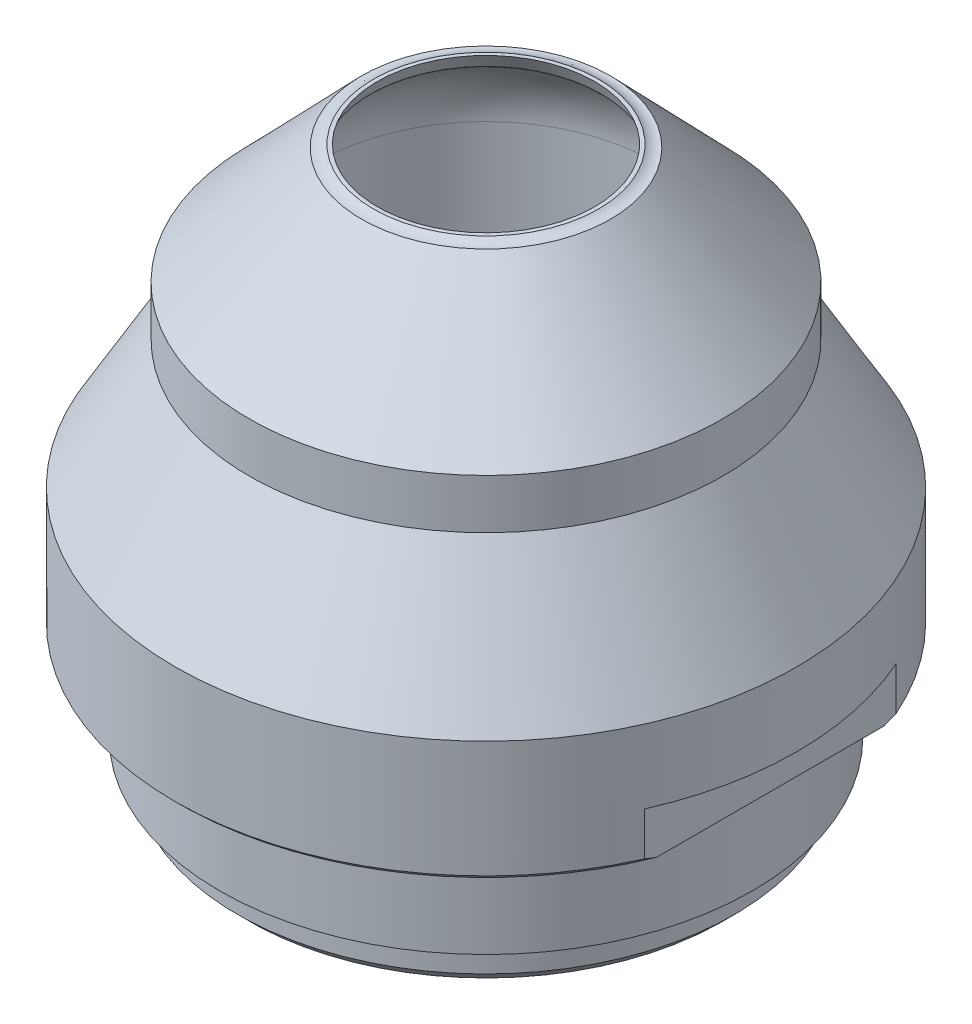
from build123d import *

# Parameters (mm, degrees)
CHAMFER_1_SIZE       = 2
FILLET_1_R           = 0.25
CHAMFER_2_SIZE       = 0.8
SKETCH_2_OUTSIDE_W   = 142.116
SKETCH_2_OUTSIDE_H   = 142.116
SKETCH_2_OUTSIDE_W_2 = 96
SKETCH_2_OUTSIDE_H_2 = 105
CUT_EXTRUDE_1_DEPTH  = 8.1


with BuildPart() as part:
    # Sketch 1 → Revolve 1 (revolve)
    with BuildSketch(Plane.XY, mode=Mode.PRIVATE) as revolve_1_sk:
        with BuildLine():
            Line((18.35, 93.7), (19, 93.7))
            ThreePointArc((19, 93.7), (19.955702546, 93.272810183), (21, 93.2))
            Line((21, 93.2), (40, 73.524924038))
            Line((40, 73.524924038), (40, 65.150635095))
            Line((40, 65.150635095), (52.5, 43.5))
            Line((52.5, 43.5), (52.5, 23))
            Line((52.5, 23), (43, 23))
            Line((43, 23), (43, 20.7))
            Line((43, 20.7), (45, 20.7))
            Line((45, 20.7), (45, 7))
            Line((45, 7), (41.95, 7))
            Line((41.95, 7), (41.95, 0))
            Line((41.95, 0), (35, 0))
            Line((35, 0), (35, 26))
            Line((35, 26), (28.5, 50))
            Line((28.5, 50), (28.5, 76.846322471))
            ThreePointArc((28.5, 76.846322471), (26.064659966, 85.331603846), (19.5, 91.233817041))
            Line((19.5, 91.233817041), (18.35, 93.7))
        make_face()
    revolve(revolve_1_sk.sketch.rotate(Axis((0, 0, 0), (0, 1, 0)), 90), axis=Axis((0, 0, 0), (0, 1, 0)))

    # Chamfer 1
    chamfer_1_edges = [part.edges().sort_by_distance(p)[0] for p in [
        (0, 0, 41.95),
    ]]
    chamfer(chamfer_1_edges, length=CHAMFER_1_SIZE)

    # Fillet 1
    fillet_1_edges = [part.edges().sort_by_distance(p)[0] for p in [
        (0, 0, 35),
        (0, 26, 35),
        (0, 50, 28.5),
        (0, 91.233817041, 19.5),
    ]]
    fillet(fillet_1_edges, radius=FILLET_1_R)

    # Chamfer 2
    chamfer_2_edges = [part.edges().sort_by_distance(p)[0] for p in [
        (0, 23, 52.5),
    ]]
    chamfer(chamfer_2_edges, length=CHAMFER_2_SIZE)

    # Sketch 2 outside → Cut-Extrude 1 (cut)
    with BuildSketch(Plane.XZ.offset(-23)):
        Rectangle(SKETCH_2_OUTSIDE_W, SKETCH_2_OUTSIDE_H)
        Rectangle(SKETCH_2_OUTSIDE_W_2, SKETCH_2_OUTSIDE_H_2, mode=Mode.SUBTRACT)
    extrude(amount=-CUT_EXTRUDE_1_DEPTH, mode=Mode.SUBTRACT)


solid = part.part
